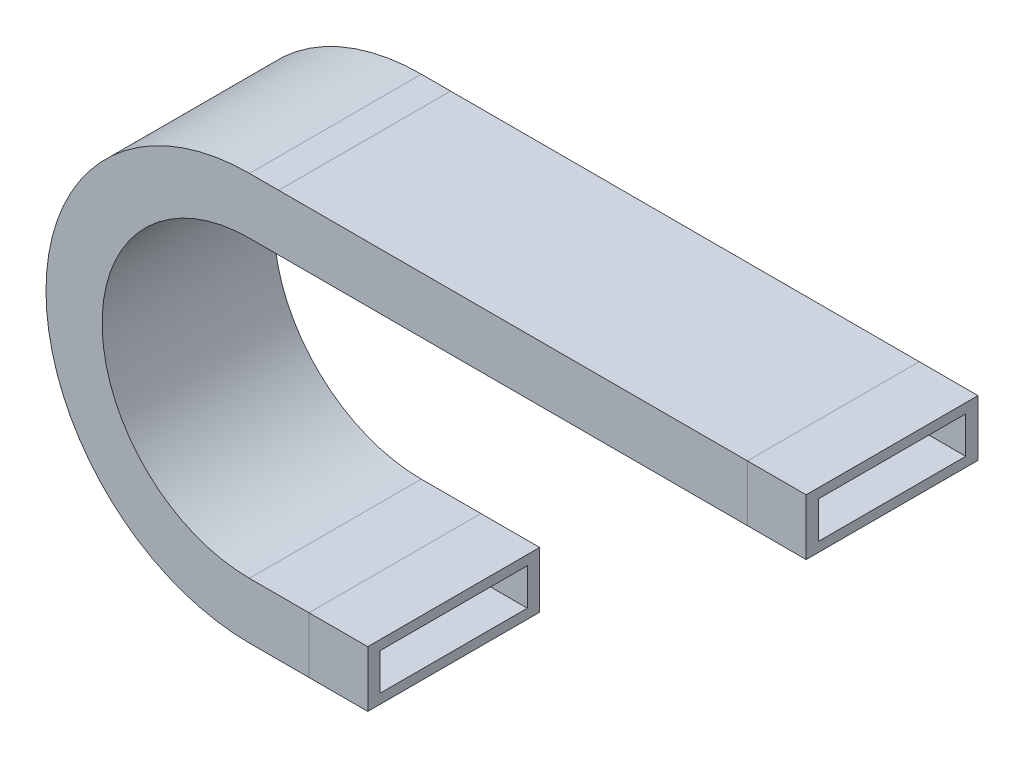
ISO-10303-21;
HEADER;
FILE_DESCRIPTION(('STEP AP214'),'2;1');
FILE_NAME('part.step','',(''),(''),'','','');
FILE_SCHEMA(('AUTOMOTIVE_DESIGN { 1 0 10303 214 1 1 1 1 }'));
ENDSEC;
DATA;
#1=APPLICATION_CONTEXT('core data for automotive mechanical design processes');
#2=APPLICATION_PROTOCOL_DEFINITION('international standard','automotive_design',2000,#1);
#3=PRODUCT_CONTEXT('',#1,'mechanical');
#4=PRODUCT('Part','Part','',(#3));
#5=PRODUCT_RELATED_PRODUCT_CATEGORY('part','',(#4));
#6=PRODUCT_DEFINITION_FORMATION('','',#4);
#7=PRODUCT_DEFINITION_CONTEXT('part definition',#1,'design');
#8=PRODUCT_DEFINITION('design','',#6,#7);
#9=PRODUCT_DEFINITION_SHAPE('','',#8);
#10=(LENGTH_UNIT() NAMED_UNIT(*) SI_UNIT(.MILLI.,.METRE.));
#11=(NAMED_UNIT(*) PLANE_ANGLE_UNIT() SI_UNIT($,.RADIAN.));
#12=(NAMED_UNIT(*) SI_UNIT($,.STERADIAN.) SOLID_ANGLE_UNIT());
#13=UNCERTAINTY_MEASURE_WITH_UNIT(LENGTH_MEASURE(1.E-05),#10,'distance_accuracy_value','');
#14=(GEOMETRIC_REPRESENTATION_CONTEXT(3) GLOBAL_UNCERTAINTY_ASSIGNED_CONTEXT((#13)) GLOBAL_UNIT_ASSIGNED_CONTEXT((#10,
#11,#12)) REPRESENTATION_CONTEXT('',''));
#15=CARTESIAN_POINT('',(0.,0.,0.));
#16=DIRECTION('',(0.,0.,1.));
#17=DIRECTION('',(1.,0.,0.));
#18=AXIS2_PLACEMENT_3D('',#15,#16,#17);
#19=CARTESIAN_POINT('',(-135.,0.,98.));
#20=DIRECTION('',(0.,1.,0.));
#21=DIRECTION('',(0.,0.,1.));
#22=AXIS2_PLACEMENT_3D('',#19,#20,#21);
#23=PLANE('',#22);
#24=DIRECTION('',(0.,0.,1.));
#25=VECTOR('',#24,1.);
#26=CARTESIAN_POINT('',(-135.,0.,98.));
#27=LINE('',#26,#25);
#28=CARTESIAN_POINT('',(-135.,0.,-98.));
#29=VERTEX_POINT('',#28);
#30=CARTESIAN_POINT('',(-135.,0.,98.));
#31=VERTEX_POINT('',#30);
#32=EDGE_CURVE('P0_E314',#29,#31,#27,.T.);
#33=ORIENTED_EDGE('',*,*,#32,.F.);
#34=DIRECTION('',(1.,0.,0.));
#35=VECTOR('',#34,1.);
#36=CARTESIAN_POINT('',(-135.,0.,-98.));
#37=LINE('',#36,#35);
#38=CARTESIAN_POINT('',(-66.9999999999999,0.,-98.));
#39=VERTEX_POINT('',#38);
#40=EDGE_CURVE('P0_E31',#29,#39,#37,.T.);
#41=ORIENTED_EDGE('',*,*,#40,.T.);
#42=DIRECTION('',(0.,0.,1.));
#43=VECTOR('',#42,1.);
#44=CARTESIAN_POINT('',(-66.9999999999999,0.,98.));
#45=LINE('',#44,#43);
#46=CARTESIAN_POINT('',(-66.9999999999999,0.,98.));
#47=VERTEX_POINT('',#46);
#48=EDGE_CURVE('P0_E38',#39,#47,#45,.T.);
#49=ORIENTED_EDGE('',*,*,#48,.T.);
#50=DIRECTION('',(1.,0.,0.));
#51=VECTOR('',#50,1.);
#52=CARTESIAN_POINT('',(-135.,0.,98.));
#53=LINE('',#52,#51);
#54=EDGE_CURVE('P0_E13',#31,#47,#53,.T.);
#55=ORIENTED_EDGE('',*,*,#54,.F.);
#56=EDGE_LOOP('',(#33,#41,#49,#55));
#57=FACE_BOUND('',#56,.T.);
#58=ADVANCED_FACE('P0_F24',(#57),#23,.F.);
#59=CARTESIAN_POINT('',(-135.,64.,98.));
#60=DIRECTION('',(0.,-1.,0.));
#61=DIRECTION('',(0.,0.,-1.));
#62=AXIS2_PLACEMENT_3D('',#59,#60,#61);
#63=PLANE('',#62);
#64=DIRECTION('',(0.,0.,-1.));
#65=VECTOR('',#64,1.);
#66=CARTESIAN_POINT('',(-135.,64.,98.));
#67=LINE('',#66,#65);
#68=CARTESIAN_POINT('',(-135.,64.,98.));
#69=VERTEX_POINT('',#68);
#70=CARTESIAN_POINT('',(-135.,64.,-98.));
#71=VERTEX_POINT('',#70);
#72=EDGE_CURVE('P0_E311',#69,#71,#67,.T.);
#73=ORIENTED_EDGE('',*,*,#72,.F.);
#74=DIRECTION('',(1.,0.,0.));
#75=VECTOR('',#74,1.);
#76=CARTESIAN_POINT('',(-135.,64.,98.));
#77=LINE('',#76,#75);
#78=CARTESIAN_POINT('',(-66.9999999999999,64.,98.));
#79=VERTEX_POINT('',#78);
#80=EDGE_CURVE('P0_E337',#69,#79,#77,.T.);
#81=ORIENTED_EDGE('',*,*,#80,.T.);
#82=DIRECTION('',(0.,0.,-1.));
#83=VECTOR('',#82,1.);
#84=CARTESIAN_POINT('',(-66.9999999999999,64.,98.));
#85=LINE('',#84,#83);
#86=CARTESIAN_POINT('',(-66.9999999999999,64.,-98.));
#87=VERTEX_POINT('',#86);
#88=EDGE_CURVE('P0_E332',#79,#87,#85,.T.);
#89=ORIENTED_EDGE('',*,*,#88,.T.);
#90=DIRECTION('',(1.,0.,0.));
#91=VECTOR('',#90,1.);
#92=CARTESIAN_POINT('',(-135.,64.,-98.));
#93=LINE('',#92,#91);
#94=EDGE_CURVE('P0_E350',#71,#87,#93,.T.);
#95=ORIENTED_EDGE('',*,*,#94,.F.);
#96=EDGE_LOOP('',(#73,#81,#89,#95));
#97=FACE_BOUND('',#96,.T.);
#98=ADVANCED_FACE('P0_F429',(#97),#63,.F.);
#99=CARTESIAN_POINT('',(-135.,53.,84.));
#100=DIRECTION('',(0.,-1.,0.));
#101=DIRECTION('',(0.,0.,-1.));
#102=AXIS2_PLACEMENT_3D('',#99,#100,#101);
#103=PLANE('',#102);
#104=DIRECTION('',(0.,0.,-1.));
#105=VECTOR('',#104,1.);
#106=CARTESIAN_POINT('',(-135.,53.,84.));
#107=LINE('',#106,#105);
#108=CARTESIAN_POINT('',(-135.,53.,84.));
#109=VERTEX_POINT('',#108);
#110=CARTESIAN_POINT('',(-135.,53.,-84.));
#111=VERTEX_POINT('',#110);
#112=EDGE_CURVE('P0_E308',#109,#111,#107,.T.);
#113=ORIENTED_EDGE('',*,*,#112,.T.);
#114=DIRECTION('',(1.,0.,0.));
#115=VECTOR('',#114,1.);
#116=CARTESIAN_POINT('',(-135.,53.,-84.));
#117=LINE('',#116,#115);
#118=CARTESIAN_POINT('',(-66.9999999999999,53.,-84.));
#119=VERTEX_POINT('',#118);
#120=EDGE_CURVE('P0_E343',#111,#119,#117,.T.);
#121=ORIENTED_EDGE('',*,*,#120,.T.);
#122=DIRECTION('',(0.,0.,-1.));
#123=VECTOR('',#122,1.);
#124=CARTESIAN_POINT('',(-66.9999999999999,53.,84.));
#125=LINE('',#124,#123);
#126=CARTESIAN_POINT('',(-66.9999999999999,53.,84.));
#127=VERTEX_POINT('',#126);
#128=EDGE_CURVE('P0_E326',#127,#119,#125,.T.);
#129=ORIENTED_EDGE('',*,*,#128,.F.);
#130=DIRECTION('',(1.,0.,0.));
#131=VECTOR('',#130,1.);
#132=CARTESIAN_POINT('',(-135.,53.,84.));
#133=LINE('',#132,#131);
#134=EDGE_CURVE('P0_E333',#109,#127,#133,.T.);
#135=ORIENTED_EDGE('',*,*,#134,.F.);
#136=EDGE_LOOP('',(#113,#121,#129,#135));
#137=FACE_BOUND('',#136,.T.);
#138=ADVANCED_FACE('P0_F447',(#137),#103,.T.);
#139=CARTESIAN_POINT('',(-135.,11.,84.));
#140=DIRECTION('',(0.,1.,0.));
#141=DIRECTION('',(0.,0.,1.));
#142=AXIS2_PLACEMENT_3D('',#139,#140,#141);
#143=PLANE('',#142);
#144=DIRECTION('',(0.,0.,1.));
#145=VECTOR('',#144,1.);
#146=CARTESIAN_POINT('',(-135.,11.,84.));
#147=LINE('',#146,#145);
#148=CARTESIAN_POINT('',(-135.,11.,-84.));
#149=VERTEX_POINT('',#148);
#150=CARTESIAN_POINT('',(-135.,11.,84.));
#151=VERTEX_POINT('',#150);
#152=EDGE_CURVE('P0_E305',#149,#151,#147,.T.);
#153=ORIENTED_EDGE('',*,*,#152,.T.);
#154=DIRECTION('',(1.,0.,0.));
#155=VECTOR('',#154,1.);
#156=CARTESIAN_POINT('',(-135.,11.,84.));
#157=LINE('',#156,#155);
#158=CARTESIAN_POINT('',(-66.9999999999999,11.,84.));
#159=VERTEX_POINT('',#158);
#160=EDGE_CURVE('P0_E329',#151,#159,#157,.T.);
#161=ORIENTED_EDGE('',*,*,#160,.T.);
#162=DIRECTION('',(0.,0.,1.));
#163=VECTOR('',#162,1.);
#164=CARTESIAN_POINT('',(-66.9999999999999,11.,84.));
#165=LINE('',#164,#163);
#166=CARTESIAN_POINT('',(-66.9999999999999,11.,-84.));
#167=VERTEX_POINT('',#166);
#168=EDGE_CURVE('P0_E320',#167,#159,#165,.T.);
#169=ORIENTED_EDGE('',*,*,#168,.F.);
#170=DIRECTION('',(1.,0.,0.));
#171=VECTOR('',#170,1.);
#172=CARTESIAN_POINT('',(-135.,11.,-84.));
#173=LINE('',#172,#171);
#174=EDGE_CURVE('P0_E340',#149,#167,#173,.T.);
#175=ORIENTED_EDGE('',*,*,#174,.F.);
#176=EDGE_LOOP('',(#153,#161,#169,#175));
#177=FACE_BOUND('',#176,.T.);
#178=ADVANCED_FACE('P0_F451',(#177),#143,.T.);
#179=CARTESIAN_POINT('',(-135.,232.01,0.));
#180=DIRECTION('',(0.,0.,1.));
#181=DIRECTION('',(1.,0.,0.));
#182=AXIS2_PLACEMENT_3D('',#179,#180,#181);
#183=CYLINDRICAL_SURFACE('',#182,232.01);
#184=DIRECTION('',(0.,0.,1.));
#185=VECTOR('',#184,1.);
#186=CARTESIAN_POINT('',(-134.86094750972,464.019958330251,98.));
#187=LINE('',#186,#185);
#188=CARTESIAN_POINT('',(-134.86094750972,464.019958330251,-98.));
#189=VERTEX_POINT('',#188);
#190=CARTESIAN_POINT('',(-134.86094750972,464.019958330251,98.));
#191=VERTEX_POINT('',#190);
#192=EDGE_CURVE('P0_E264',#189,#191,#187,.T.);
#193=ORIENTED_EDGE('',*,*,#192,.F.);
#194=CARTESIAN_POINT('',(-135.,232.01,-98.));
#195=DIRECTION('',(0.,0.,1.));
#196=DIRECTION('',(1.,0.,0.));
#197=AXIS2_PLACEMENT_3D('',#194,#195,#196);
#198=CIRCLE('',#197,232.01);
#199=EDGE_CURVE('P0_E301',#189,#29,#198,.T.);
#200=ORIENTED_EDGE('',*,*,#199,.T.);
#201=ORIENTED_EDGE('',*,*,#32,.T.);
#202=CARTESIAN_POINT('',(-135.,232.01,98.));
#203=DIRECTION('',(0.,0.,1.));
#204=DIRECTION('',(1.,0.,0.));
#205=AXIS2_PLACEMENT_3D('',#202,#203,#204);
#206=CIRCLE('',#205,232.01);
#207=EDGE_CURVE('P0_E303',#191,#31,#206,.T.);
#208=ORIENTED_EDGE('',*,*,#207,.F.);
#209=EDGE_LOOP('',(#193,#200,#201,#208));
#210=FACE_BOUND('',#209,.T.);
#211=ADVANCED_FACE('P0_F357',(#210),#183,.T.);
#212=CARTESIAN_POINT('',(-135.,232.01,0.));
#213=DIRECTION('',(0.,0.,1.));
#214=DIRECTION('',(1.,0.,0.));
#215=AXIS2_PLACEMENT_3D('',#212,#213,#214);
#216=CYLINDRICAL_SURFACE('',#215,168.01);
#217=DIRECTION('',(0.,0.,-1.));
#218=VECTOR('',#217,1.);
#219=CARTESIAN_POINT('',(-134.899305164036,400.019969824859,98.));
#220=LINE('',#219,#218);
#221=CARTESIAN_POINT('',(-134.899305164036,400.019969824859,98.));
#222=VERTEX_POINT('',#221);
#223=CARTESIAN_POINT('',(-134.899305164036,400.019969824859,-98.));
#224=VERTEX_POINT('',#223);
#225=EDGE_CURVE('P0_E261',#222,#224,#220,.T.);
#226=ORIENTED_EDGE('',*,*,#225,.F.);
#227=CARTESIAN_POINT('',(-135.,232.01,98.));
#228=DIRECTION('',(0.,0.,1.));
#229=DIRECTION('',(1.,0.,0.));
#230=AXIS2_PLACEMENT_3D('',#227,#228,#229);
#231=CIRCLE('',#230,168.01);
#232=EDGE_CURVE('P0_E297',#222,#69,#231,.T.);
#233=ORIENTED_EDGE('',*,*,#232,.T.);
#234=ORIENTED_EDGE('',*,*,#72,.T.);
#235=CARTESIAN_POINT('',(-135.,232.01,-98.));
#236=DIRECTION('',(0.,0.,1.));
#237=DIRECTION('',(1.,0.,0.));
#238=AXIS2_PLACEMENT_3D('',#235,#236,#237);
#239=CIRCLE('',#238,168.01);
#240=EDGE_CURVE('P0_E299',#224,#71,#239,.T.);
#241=ORIENTED_EDGE('',*,*,#240,.F.);
#242=EDGE_LOOP('',(#226,#233,#234,#241));
#243=FACE_BOUND('',#242,.T.);
#244=ADVANCED_FACE('P0_F424',(#243),#216,.F.);
#245=CARTESIAN_POINT('',(-135.,232.01,0.));
#246=DIRECTION('',(0.,0.,1.));
#247=DIRECTION('',(1.,0.,0.));
#248=AXIS2_PLACEMENT_3D('',#245,#246,#247);
#249=CYLINDRICAL_SURFACE('',#248,179.01);
#250=DIRECTION('',(0.,0.,-1.));
#251=VECTOR('',#250,1.);
#252=CARTESIAN_POINT('',(-134.892712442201,411.019967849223,84.));
#253=LINE('',#252,#251);
#254=CARTESIAN_POINT('',(-134.892712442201,411.019967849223,84.));
#255=VERTEX_POINT('',#254);
#256=CARTESIAN_POINT('',(-134.892712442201,411.019967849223,-84.));
#257=VERTEX_POINT('',#256);
#258=EDGE_CURVE('P0_E258',#255,#257,#253,.T.);
#259=ORIENTED_EDGE('',*,*,#258,.T.);
#260=CARTESIAN_POINT('',(-135.,232.01,-84.));
#261=DIRECTION('',(0.,0.,1.));
#262=DIRECTION('',(1.,0.,0.));
#263=AXIS2_PLACEMENT_3D('',#260,#261,#262);
#264=CIRCLE('',#263,179.01);
#265=EDGE_CURVE('P0_E293',#257,#111,#264,.T.);
#266=ORIENTED_EDGE('',*,*,#265,.T.);
#267=ORIENTED_EDGE('',*,*,#112,.F.);
#268=CARTESIAN_POINT('',(-135.,232.01,84.));
#269=DIRECTION('',(0.,0.,1.));
#270=DIRECTION('',(1.,0.,0.));
#271=AXIS2_PLACEMENT_3D('',#268,#269,#270);
#272=CIRCLE('',#271,179.01);
#273=EDGE_CURVE('P0_E295',#255,#109,#272,.T.);
#274=ORIENTED_EDGE('',*,*,#273,.F.);
#275=EDGE_LOOP('',(#259,#266,#267,#274));
#276=FACE_BOUND('',#275,.T.);
#277=ADVANCED_FACE('P0_F462',(#276),#249,.T.);
#278=CARTESIAN_POINT('',(-135.,232.01,0.));
#279=DIRECTION('',(0.,0.,1.));
#280=DIRECTION('',(1.,0.,0.));
#281=AXIS2_PLACEMENT_3D('',#278,#279,#280);
#282=CYLINDRICAL_SURFACE('',#281,221.01);
#283=DIRECTION('',(0.,0.,1.));
#284=VECTOR('',#283,1.);
#285=CARTESIAN_POINT('',(-134.867540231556,453.019960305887,84.));
#286=LINE('',#285,#284);
#287=CARTESIAN_POINT('',(-134.867540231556,453.019960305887,-84.));
#288=VERTEX_POINT('',#287);
#289=CARTESIAN_POINT('',(-134.867540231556,453.019960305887,84.));
#290=VERTEX_POINT('',#289);
#291=EDGE_CURVE('P0_E255',#288,#290,#286,.T.);
#292=ORIENTED_EDGE('',*,*,#291,.T.);
#293=CARTESIAN_POINT('',(-135.,232.01,84.));
#294=DIRECTION('',(0.,0.,1.));
#295=DIRECTION('',(1.,0.,0.));
#296=AXIS2_PLACEMENT_3D('',#293,#294,#295);
#297=CIRCLE('',#296,221.01);
#298=EDGE_CURVE('P0_E289',#290,#151,#297,.T.);
#299=ORIENTED_EDGE('',*,*,#298,.T.);
#300=ORIENTED_EDGE('',*,*,#152,.F.);
#301=CARTESIAN_POINT('',(-135.,232.01,-84.));
#302=DIRECTION('',(0.,0.,1.));
#303=DIRECTION('',(1.,0.,0.));
#304=AXIS2_PLACEMENT_3D('',#301,#302,#303);
#305=CIRCLE('',#304,221.01);
#306=EDGE_CURVE('P0_E291',#288,#149,#305,.T.);
#307=ORIENTED_EDGE('',*,*,#306,.F.);
#308=EDGE_LOOP('',(#292,#299,#300,#307));
#309=FACE_BOUND('',#308,.T.);
#310=ADVANCED_FACE('P0_F465',(#309),#282,.F.);
#311=CARTESIAN_POINT('',(-101.610694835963,464.000030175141,98.));
#312=DIRECTION('',(-0.000599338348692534,-0.999999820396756,0.));
#313=DIRECTION('',(0.999999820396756,-0.000599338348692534,0.));
#314=AXIS2_PLACEMENT_3D('',#311,#312,#313);
#315=PLANE('',#314);
#316=DIRECTION('',(0.,0.,1.));
#317=VECTOR('',#316,1.);
#318=CARTESIAN_POINT('',(-101.610694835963,464.000030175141,98.));
#319=LINE('',#318,#317);
#320=CARTESIAN_POINT('',(-101.610694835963,464.000030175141,-98.));
#321=VERTEX_POINT('',#320);
#322=CARTESIAN_POINT('',(-101.610694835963,464.000030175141,98.));
#323=VERTEX_POINT('',#322);
#324=EDGE_CURVE('P0_E233',#321,#323,#319,.T.);
#325=ORIENTED_EDGE('',*,*,#324,.F.);
#326=DIRECTION('',(-0.999999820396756,0.000599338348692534,0.));
#327=VECTOR('',#326,1.);
#328=CARTESIAN_POINT('',(-101.610694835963,464.000030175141,-98.));
#329=LINE('',#328,#327);
#330=EDGE_CURVE('P0_E283',#321,#189,#329,.T.);
#331=ORIENTED_EDGE('',*,*,#330,.T.);
#332=ORIENTED_EDGE('',*,*,#192,.T.);
#333=DIRECTION('',(-0.999999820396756,0.000599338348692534,0.));
#334=VECTOR('',#333,1.);
#335=CARTESIAN_POINT('',(-101.610694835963,464.000030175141,98.));
#336=LINE('',#335,#334);
#337=EDGE_CURVE('P0_E286',#323,#191,#336,.T.);
#338=ORIENTED_EDGE('',*,*,#337,.F.);
#339=EDGE_LOOP('',(#325,#331,#332,#338));
#340=FACE_BOUND('',#339,.T.);
#341=ADVANCED_FACE('P0_F359',(#340),#315,.F.);
#342=CARTESIAN_POINT('',(-101.649052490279,400.000041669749,98.));
#343=DIRECTION('',(0.000599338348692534,0.999999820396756,0.));
#344=DIRECTION('',(-0.999999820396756,0.000599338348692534,0.));
#345=AXIS2_PLACEMENT_3D('',#342,#343,#344);
#346=PLANE('',#345);
#347=DIRECTION('',(0.,0.,-1.));
#348=VECTOR('',#347,1.);
#349=CARTESIAN_POINT('',(-101.649052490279,400.000041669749,98.));
#350=LINE('',#349,#348);
#351=CARTESIAN_POINT('',(-101.649052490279,400.000041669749,98.));
#352=VERTEX_POINT('',#351);
#353=CARTESIAN_POINT('',(-101.649052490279,400.000041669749,-98.));
#354=VERTEX_POINT('',#353);
#355=EDGE_CURVE('P0_E230',#352,#354,#350,.T.);
#356=ORIENTED_EDGE('',*,*,#355,.F.);
#357=DIRECTION('',(-0.999999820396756,0.000599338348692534,0.));
#358=VECTOR('',#357,1.);
#359=CARTESIAN_POINT('',(-101.649052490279,400.000041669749,98.));
#360=LINE('',#359,#358);
#361=EDGE_CURVE('P0_E268',#352,#222,#360,.T.);
#362=ORIENTED_EDGE('',*,*,#361,.T.);
#363=ORIENTED_EDGE('',*,*,#225,.T.);
#364=DIRECTION('',(-0.999999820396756,0.000599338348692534,0.));
#365=VECTOR('',#364,1.);
#366=CARTESIAN_POINT('',(-101.649052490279,400.000041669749,-98.));
#367=LINE('',#366,#365);
#368=EDGE_CURVE('P0_E280',#354,#224,#367,.T.);
#369=ORIENTED_EDGE('',*,*,#368,.F.);
#370=EDGE_LOOP('',(#356,#362,#363,#369));
#371=FACE_BOUND('',#370,.T.);
#372=ADVANCED_FACE('P0_F421',(#371),#346,.F.);
#373=CARTESIAN_POINT('',(-101.642459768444,411.000039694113,84.));
#374=DIRECTION('',(0.000599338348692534,0.999999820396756,0.));
#375=DIRECTION('',(-0.999999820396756,0.000599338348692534,0.));
#376=AXIS2_PLACEMENT_3D('',#373,#374,#375);
#377=PLANE('',#376);
#378=DIRECTION('',(0.,0.,-1.));
#379=VECTOR('',#378,1.);
#380=CARTESIAN_POINT('',(-101.642459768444,411.000039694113,84.));
#381=LINE('',#380,#379);
#382=CARTESIAN_POINT('',(-101.642459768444,411.000039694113,84.));
#383=VERTEX_POINT('',#382);
#384=CARTESIAN_POINT('',(-101.642459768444,411.000039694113,-84.));
#385=VERTEX_POINT('',#384);
#386=EDGE_CURVE('P0_E200',#383,#385,#381,.T.);
#387=ORIENTED_EDGE('',*,*,#386,.T.);
#388=DIRECTION('',(-0.999999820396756,0.000599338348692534,0.));
#389=VECTOR('',#388,1.);
#390=CARTESIAN_POINT('',(-101.642459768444,411.000039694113,-84.));
#391=LINE('',#390,#389);
#392=EDGE_CURVE('P0_E273',#385,#257,#391,.T.);
#393=ORIENTED_EDGE('',*,*,#392,.T.);
#394=ORIENTED_EDGE('',*,*,#258,.F.);
#395=DIRECTION('',(-0.999999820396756,0.000599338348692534,0.));
#396=VECTOR('',#395,1.);
#397=CARTESIAN_POINT('',(-101.642459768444,411.000039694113,84.));
#398=LINE('',#397,#396);
#399=EDGE_CURVE('P0_E265',#383,#255,#398,.T.);
#400=ORIENTED_EDGE('',*,*,#399,.F.);
#401=EDGE_LOOP('',(#387,#393,#394,#400));
#402=FACE_BOUND('',#401,.T.);
#403=ADVANCED_FACE('P0_F474',(#402),#377,.T.);
#404=CARTESIAN_POINT('',(-101.617287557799,453.000032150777,84.));
#405=DIRECTION('',(-0.000599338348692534,-0.999999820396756,0.));
#406=DIRECTION('',(0.999999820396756,-0.000599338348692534,0.));
#407=AXIS2_PLACEMENT_3D('',#404,#405,#406);
#408=PLANE('',#407);
#409=DIRECTION('',(0.,0.,1.));
#410=VECTOR('',#409,1.);
#411=CARTESIAN_POINT('',(-101.617287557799,453.000032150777,84.));
#412=LINE('',#411,#410);
#413=CARTESIAN_POINT('',(-101.617287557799,453.000032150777,-84.));
#414=VERTEX_POINT('',#413);
#415=CARTESIAN_POINT('',(-101.617287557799,453.000032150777,84.));
#416=VERTEX_POINT('',#415);
#417=EDGE_CURVE('P0_E225',#414,#416,#412,.T.);
#418=ORIENTED_EDGE('',*,*,#417,.T.);
#419=DIRECTION('',(-0.999999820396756,0.000599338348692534,0.));
#420=VECTOR('',#419,1.);
#421=CARTESIAN_POINT('',(-101.617287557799,453.000032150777,84.));
#422=LINE('',#421,#420);
#423=EDGE_CURVE('P0_E195',#416,#290,#422,.T.);
#424=ORIENTED_EDGE('',*,*,#423,.T.);
#425=ORIENTED_EDGE('',*,*,#291,.F.);
#426=DIRECTION('',(-0.999999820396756,0.000599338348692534,0.));
#427=VECTOR('',#426,1.);
#428=CARTESIAN_POINT('',(-101.617287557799,453.000032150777,-84.));
#429=LINE('',#428,#427);
#430=EDGE_CURVE('P0_E270',#414,#288,#429,.T.);
#431=ORIENTED_EDGE('',*,*,#430,.F.);
#432=EDGE_LOOP('',(#418,#424,#425,#431));
#433=FACE_BOUND('',#432,.T.);
#434=ADVANCED_FACE('P0_F477',(#433),#408,.T.);
#435=CARTESIAN_POINT('',(-101.51,632.01,0.));
#436=DIRECTION('',(0.,0.,-1.));
#437=DIRECTION('',(-1.,0.,0.));
#438=AXIS2_PLACEMENT_3D('',#435,#436,#437);
#439=CYLINDRICAL_SURFACE('',#438,168.01);
#440=DIRECTION('',(0.,0.,1.));
#441=VECTOR('',#440,1.);
#442=CARTESIAN_POINT('',(-101.51,464.,98.));
#443=LINE('',#442,#441);
#444=CARTESIAN_POINT('',(-101.51,464.,-98.));
#445=VERTEX_POINT('',#444);
#446=CARTESIAN_POINT('',(-101.51,464.,98.));
#447=VERTEX_POINT('',#446);
#448=EDGE_CURVE('P0_E216',#445,#447,#443,.T.);
#449=ORIENTED_EDGE('',*,*,#448,.F.);
#450=CARTESIAN_POINT('',(-101.51,632.01,-98.));
#451=DIRECTION('',(0.,0.,-1.));
#452=DIRECTION('',(-1.,0.,0.));
#453=AXIS2_PLACEMENT_3D('',#450,#451,#452);
#454=CIRCLE('',#453,168.01);
#455=EDGE_CURVE('P0_E249',#445,#321,#454,.T.);
#456=ORIENTED_EDGE('',*,*,#455,.T.);
#457=ORIENTED_EDGE('',*,*,#324,.T.);
#458=CARTESIAN_POINT('',(-101.51,632.01,98.));
#459=DIRECTION('',(0.,0.,-1.));
#460=DIRECTION('',(-1.,0.,0.));
#461=AXIS2_PLACEMENT_3D('',#458,#459,#460);
#462=CIRCLE('',#461,168.01);
#463=EDGE_CURVE('P0_E252',#447,#323,#462,.T.);
#464=ORIENTED_EDGE('',*,*,#463,.F.);
#465=EDGE_LOOP('',(#449,#456,#457,#464));
#466=FACE_BOUND('',#465,.T.);
#467=ADVANCED_FACE('P0_F362',(#466),#439,.F.);
#468=CARTESIAN_POINT('',(-101.51,632.01,0.));
#469=DIRECTION('',(0.,0.,-1.));
#470=DIRECTION('',(-1.,0.,0.));
#471=AXIS2_PLACEMENT_3D('',#468,#469,#470);
#472=CYLINDRICAL_SURFACE('',#471,232.01);
#473=DIRECTION('',(0.,0.,-1.));
#474=VECTOR('',#473,1.);
#475=CARTESIAN_POINT('',(-101.51,400.,98.));
#476=LINE('',#475,#474);
#477=CARTESIAN_POINT('',(-101.51,400.,98.));
#478=VERTEX_POINT('',#477);
#479=CARTESIAN_POINT('',(-101.51,400.,-98.));
#480=VERTEX_POINT('',#479);
#481=EDGE_CURVE('P0_E221',#478,#480,#476,.T.);
#482=ORIENTED_EDGE('',*,*,#481,.F.);
#483=CARTESIAN_POINT('',(-101.51,632.01,98.));
#484=DIRECTION('',(0.,0.,-1.));
#485=DIRECTION('',(-1.,0.,0.));
#486=AXIS2_PLACEMENT_3D('',#483,#484,#485);
#487=CIRCLE('',#486,232.01);
#488=EDGE_CURVE('P0_E236',#478,#352,#487,.T.);
#489=ORIENTED_EDGE('',*,*,#488,.T.);
#490=ORIENTED_EDGE('',*,*,#355,.T.);
#491=CARTESIAN_POINT('',(-101.51,632.01,-98.));
#492=DIRECTION('',(0.,0.,-1.));
#493=DIRECTION('',(-1.,0.,0.));
#494=AXIS2_PLACEMENT_3D('',#491,#492,#493);
#495=CIRCLE('',#494,232.01);
#496=EDGE_CURVE('P0_E246',#480,#354,#495,.T.);
#497=ORIENTED_EDGE('',*,*,#496,.F.);
#498=EDGE_LOOP('',(#482,#489,#490,#497));
#499=FACE_BOUND('',#498,.T.);
#500=ADVANCED_FACE('P0_F418',(#499),#472,.T.);
#501=CARTESIAN_POINT('',(-101.51,632.01,0.));
#502=DIRECTION('',(0.,0.,-1.));
#503=DIRECTION('',(-1.,0.,0.));
#504=AXIS2_PLACEMENT_3D('',#501,#502,#503);
#505=CYLINDRICAL_SURFACE('',#504,221.01);
#506=DIRECTION('',(0.,0.,-1.));
#507=VECTOR('',#506,1.);
#508=CARTESIAN_POINT('',(-101.51,411.,84.));
#509=LINE('',#508,#507);
#510=CARTESIAN_POINT('',(-101.51,411.,84.));
#511=VERTEX_POINT('',#510);
#512=CARTESIAN_POINT('',(-101.51,411.,-84.));
#513=VERTEX_POINT('',#512);
#514=EDGE_CURVE('P0_E209',#511,#513,#509,.T.);
#515=ORIENTED_EDGE('',*,*,#514,.T.);
#516=CARTESIAN_POINT('',(-101.51,632.01,-84.));
#517=DIRECTION('',(0.,0.,-1.));
#518=DIRECTION('',(-1.,0.,0.));
#519=AXIS2_PLACEMENT_3D('',#516,#517,#518);
#520=CIRCLE('',#519,221.01);
#521=EDGE_CURVE('P0_E239',#513,#385,#520,.T.);
#522=ORIENTED_EDGE('',*,*,#521,.T.);
#523=ORIENTED_EDGE('',*,*,#386,.F.);
#524=CARTESIAN_POINT('',(-101.51,632.01,84.));
#525=DIRECTION('',(0.,0.,-1.));
#526=DIRECTION('',(-1.,0.,0.));
#527=AXIS2_PLACEMENT_3D('',#524,#525,#526);
#528=CIRCLE('',#527,221.01);
#529=EDGE_CURVE('P0_E234',#511,#383,#528,.T.);
#530=ORIENTED_EDGE('',*,*,#529,.F.);
#531=EDGE_LOOP('',(#515,#522,#523,#530));
#532=FACE_BOUND('',#531,.T.);
#533=ADVANCED_FACE('P0_F486',(#532),#505,.F.);
#534=CARTESIAN_POINT('',(-101.51,632.01,0.));
#535=DIRECTION('',(0.,0.,-1.));
#536=DIRECTION('',(-1.,0.,0.));
#537=AXIS2_PLACEMENT_3D('',#534,#535,#536);
#538=CYLINDRICAL_SURFACE('',#537,179.01);
#539=DIRECTION('',(0.,0.,1.));
#540=VECTOR('',#539,1.);
#541=CARTESIAN_POINT('',(-101.51,453.,84.));
#542=LINE('',#541,#540);
#543=CARTESIAN_POINT('',(-101.51,453.,-84.));
#544=VERTEX_POINT('',#543);
#545=CARTESIAN_POINT('',(-101.51,453.,84.));
#546=VERTEX_POINT('',#545);
#547=EDGE_CURVE('P0_E203',#544,#546,#542,.T.);
#548=ORIENTED_EDGE('',*,*,#547,.T.);
#549=CARTESIAN_POINT('',(-101.51,632.01,84.));
#550=DIRECTION('',(0.,0.,-1.));
#551=DIRECTION('',(-1.,0.,0.));
#552=AXIS2_PLACEMENT_3D('',#549,#550,#551);
#553=CIRCLE('',#552,179.01);
#554=EDGE_CURVE('P0_E187',#546,#416,#553,.T.);
#555=ORIENTED_EDGE('',*,*,#554,.T.);
#556=ORIENTED_EDGE('',*,*,#417,.F.);
#557=CARTESIAN_POINT('',(-101.51,632.01,-84.));
#558=DIRECTION('',(0.,0.,-1.));
#559=DIRECTION('',(-1.,0.,0.));
#560=AXIS2_PLACEMENT_3D('',#557,#558,#559);
#561=CIRCLE('',#560,179.01);
#562=EDGE_CURVE('P0_E199',#544,#414,#561,.T.);
#563=ORIENTED_EDGE('',*,*,#562,.F.);
#564=EDGE_LOOP('',(#548,#555,#556,#563));
#565=FACE_BOUND('',#564,.T.);
#566=ADVANCED_FACE('P0_F204',(#565),#538,.T.);
#567=CARTESIAN_POINT('',(-101.51,464.,98.));
#568=DIRECTION('',(0.,0.,1.));
#569=DIRECTION('',(1.,0.,0.));
#570=AXIS2_PLACEMENT_3D('',#567,#568,#569);
#571=PLANE('',#570);
#572=DIRECTION('',(0.,-1.,0.));
#573=VECTOR('',#572,1.);
#574=CARTESIAN_POINT('',(433.,464.,98.));
#575=LINE('',#574,#573);
#576=CARTESIAN_POINT('',(433.,464.,98.));
#577=VERTEX_POINT('',#576);
#578=CARTESIAN_POINT('',(433.,400.,98.));
#579=VERTEX_POINT('',#578);
#580=EDGE_CURVE('P0_E404',#577,#579,#575,.T.);
#581=ORIENTED_EDGE('',*,*,#580,.F.);
#582=DIRECTION('',(1.,0.,0.));
#583=VECTOR('',#582,1.);
#584=CARTESIAN_POINT('',(-101.51,464.,98.));
#585=LINE('',#584,#583);
#586=EDGE_CURVE('P0_E227',#447,#577,#585,.T.);
#587=ORIENTED_EDGE('',*,*,#586,.F.);
#588=ORIENTED_EDGE('',*,*,#463,.T.);
#589=ORIENTED_EDGE('',*,*,#337,.T.);
#590=ORIENTED_EDGE('',*,*,#207,.T.);
#591=ORIENTED_EDGE('',*,*,#54,.T.);
#592=DIRECTION('',(0.,1.,0.));
#593=VECTOR('',#592,1.);
#594=CARTESIAN_POINT('',(-66.9999999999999,0.,98.));
#595=LINE('',#594,#593);
#596=EDGE_CURVE('P0_E330',#47,#79,#595,.T.);
#597=ORIENTED_EDGE('',*,*,#596,.T.);
#598=ORIENTED_EDGE('',*,*,#80,.F.);
#599=ORIENTED_EDGE('',*,*,#232,.F.);
#600=ORIENTED_EDGE('',*,*,#361,.F.);
#601=ORIENTED_EDGE('',*,*,#488,.F.);
#602=DIRECTION('',(1.,0.,0.));
#603=VECTOR('',#602,1.);
#604=CARTESIAN_POINT('',(-101.51,400.,98.));
#605=LINE('',#604,#603);
#606=EDGE_CURVE('P0_E388',#478,#579,#605,.T.);
#607=ORIENTED_EDGE('',*,*,#606,.T.);
#608=EDGE_LOOP('',(#581,#587,#588,#589,#590,#591,#597,#598,#599,#600,#601,#607));
#609=FACE_BOUND('',#608,.T.);
#610=ADVANCED_FACE('P0_F411',(#609),#571,.T.);
#611=CARTESIAN_POINT('',(-101.51,464.,98.));
#612=DIRECTION('',(0.,1.,0.));
#613=DIRECTION('',(-1.,0.,0.));
#614=AXIS2_PLACEMENT_3D('',#611,#612,#613);
#615=PLANE('',#614);
#616=DIRECTION('',(0.,0.,1.));
#617=VECTOR('',#616,1.);
#618=CARTESIAN_POINT('',(433.,464.,98.));
#619=LINE('',#618,#617);
#620=CARTESIAN_POINT('',(433.,464.,-98.));
#621=VERTEX_POINT('',#620);
#622=EDGE_CURVE('P0_E210',#621,#577,#619,.T.);
#623=ORIENTED_EDGE('',*,*,#622,.F.);
#624=DIRECTION('',(1.,0.,0.));
#625=VECTOR('',#624,1.);
#626=CARTESIAN_POINT('',(-101.51,464.,-98.));
#627=LINE('',#626,#625);
#628=EDGE_CURVE('P0_E364',#445,#621,#627,.T.);
#629=ORIENTED_EDGE('',*,*,#628,.F.);
#630=ORIENTED_EDGE('',*,*,#448,.T.);
#631=ORIENTED_EDGE('',*,*,#586,.T.);
#632=EDGE_LOOP('',(#623,#629,#630,#631));
#633=FACE_BOUND('',#632,.T.);
#634=ADVANCED_FACE('P0_F380',(#633),#615,.T.);
#635=CARTESIAN_POINT('',(-101.51,464.,-98.));
#636=DIRECTION('',(0.,0.,-1.));
#637=DIRECTION('',(-1.,0.,0.));
#638=AXIS2_PLACEMENT_3D('',#635,#636,#637);
#639=PLANE('',#638);
#640=DIRECTION('',(0.,1.,0.));
#641=VECTOR('',#640,1.);
#642=CARTESIAN_POINT('',(433.,464.,-98.));
#643=LINE('',#642,#641);
#644=CARTESIAN_POINT('',(433.,400.,-98.));
#645=VERTEX_POINT('',#644);
#646=EDGE_CURVE('P0_E367',#645,#621,#643,.T.);
#647=ORIENTED_EDGE('',*,*,#646,.F.);
#648=DIRECTION('',(1.,0.,0.));
#649=VECTOR('',#648,1.);
#650=CARTESIAN_POINT('',(-101.51,400.,-98.));
#651=LINE('',#650,#649);
#652=EDGE_CURVE('P0_E371',#480,#645,#651,.T.);
#653=ORIENTED_EDGE('',*,*,#652,.F.);
#654=ORIENTED_EDGE('',*,*,#496,.T.);
#655=ORIENTED_EDGE('',*,*,#368,.T.);
#656=ORIENTED_EDGE('',*,*,#240,.T.);
#657=ORIENTED_EDGE('',*,*,#94,.T.);
#658=DIRECTION('',(0.,-1.,0.));
#659=VECTOR('',#658,1.);
#660=CARTESIAN_POINT('',(-66.9999999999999,0.,-98.));
#661=LINE('',#660,#659);
#662=EDGE_CURVE('P0_E46',#87,#39,#661,.T.);
#663=ORIENTED_EDGE('',*,*,#662,.T.);
#664=ORIENTED_EDGE('',*,*,#40,.F.);
#665=ORIENTED_EDGE('',*,*,#199,.F.);
#666=ORIENTED_EDGE('',*,*,#330,.F.);
#667=ORIENTED_EDGE('',*,*,#455,.F.);
#668=ORIENTED_EDGE('',*,*,#628,.T.);
#669=EDGE_LOOP('',(#647,#653,#654,#655,#656,#657,#663,#664,#665,#666,#667,#668));
#670=FACE_BOUND('',#669,.T.);
#671=ADVANCED_FACE('P0_F353',(#670),#639,.T.);
#672=CARTESIAN_POINT('',(-101.51,453.,84.));
#673=DIRECTION('',(0.,0.,1.));
#674=DIRECTION('',(0.,-1.,0.));
#675=AXIS2_PLACEMENT_3D('',#672,#673,#674);
#676=PLANE('',#675);
#677=DIRECTION('',(0.,-1.,0.));
#678=VECTOR('',#677,1.);
#679=CARTESIAN_POINT('',(433.,453.,84.));
#680=LINE('',#679,#678);
#681=CARTESIAN_POINT('',(433.,453.,84.));
#682=VERTEX_POINT('',#681);
#683=CARTESIAN_POINT('',(433.,411.,84.));
#684=VERTEX_POINT('',#683);
#685=EDGE_CURVE('P0_E406',#682,#684,#680,.T.);
#686=ORIENTED_EDGE('',*,*,#685,.T.);
#687=DIRECTION('',(1.,0.,0.));
#688=VECTOR('',#687,1.);
#689=CARTESIAN_POINT('',(-101.51,411.,84.));
#690=LINE('',#689,#688);
#691=EDGE_CURVE('P0_E390',#511,#684,#690,.T.);
#692=ORIENTED_EDGE('',*,*,#691,.F.);
#693=ORIENTED_EDGE('',*,*,#529,.T.);
#694=ORIENTED_EDGE('',*,*,#399,.T.);
#695=ORIENTED_EDGE('',*,*,#273,.T.);
#696=ORIENTED_EDGE('',*,*,#134,.T.);
#697=DIRECTION('',(0.,1.,0.));
#698=VECTOR('',#697,1.);
#699=CARTESIAN_POINT('',(-66.9999999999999,11.,84.));
#700=LINE('',#699,#698);
#701=EDGE_CURVE('P0_E317',#159,#127,#700,.T.);
#702=ORIENTED_EDGE('',*,*,#701,.F.);
#703=ORIENTED_EDGE('',*,*,#160,.F.);
#704=ORIENTED_EDGE('',*,*,#298,.F.);
#705=ORIENTED_EDGE('',*,*,#423,.F.);
#706=ORIENTED_EDGE('',*,*,#554,.F.);
#707=DIRECTION('',(1.,0.,0.));
#708=VECTOR('',#707,1.);
#709=CARTESIAN_POINT('',(-101.51,453.,84.));
#710=LINE('',#709,#708);
#711=EDGE_CURVE('P0_E192',#546,#682,#710,.T.);
#712=ORIENTED_EDGE('',*,*,#711,.T.);
#713=EDGE_LOOP('',(#686,#692,#693,#694,#695,#696,#702,#703,#704,#705,#706,#712));
#714=FACE_BOUND('',#713,.T.);
#715=ADVANCED_FACE('P0_F190',(#714),#676,.F.);
#716=CARTESIAN_POINT('',(-101.51,411.,84.));
#717=DIRECTION('',(0.,-1.,0.));
#718=DIRECTION('',(1.,0.,0.));
#719=AXIS2_PLACEMENT_3D('',#716,#717,#718);
#720=PLANE('',#719);
#721=DIRECTION('',(0.,0.,-1.));
#722=VECTOR('',#721,1.);
#723=CARTESIAN_POINT('',(433.,411.,84.));
#724=LINE('',#723,#722);
#725=CARTESIAN_POINT('',(433.,411.,-84.));
#726=VERTEX_POINT('',#725);
#727=EDGE_CURVE('P0_E402',#684,#726,#724,.T.);
#728=ORIENTED_EDGE('',*,*,#727,.T.);
#729=DIRECTION('',(1.,0.,0.));
#730=VECTOR('',#729,1.);
#731=CARTESIAN_POINT('',(-101.51,411.,-84.));
#732=LINE('',#731,#730);
#733=EDGE_CURVE('P0_E218',#513,#726,#732,.T.);
#734=ORIENTED_EDGE('',*,*,#733,.F.);
#735=ORIENTED_EDGE('',*,*,#514,.F.);
#736=ORIENTED_EDGE('',*,*,#691,.T.);
#737=EDGE_LOOP('',(#728,#734,#735,#736));
#738=FACE_BOUND('',#737,.T.);
#739=ADVANCED_FACE('P0_F494',(#738),#720,.F.);
#740=CARTESIAN_POINT('',(-101.51,453.,-84.));
#741=DIRECTION('',(0.,0.,-1.));
#742=DIRECTION('',(-1.,0.,0.));
#743=AXIS2_PLACEMENT_3D('',#740,#741,#742);
#744=PLANE('',#743);
#745=DIRECTION('',(0.,1.,0.));
#746=VECTOR('',#745,1.);
#747=CARTESIAN_POINT('',(433.,453.,-84.));
#748=LINE('',#747,#746);
#749=CARTESIAN_POINT('',(433.,453.,-84.));
#750=VERTEX_POINT('',#749);
#751=EDGE_CURVE('P0_E397',#726,#750,#748,.T.);
#752=ORIENTED_EDGE('',*,*,#751,.T.);
#753=DIRECTION('',(1.,0.,0.));
#754=VECTOR('',#753,1.);
#755=CARTESIAN_POINT('',(-101.51,453.,-84.));
#756=LINE('',#755,#754);
#757=EDGE_CURVE('P0_E215',#544,#750,#756,.T.);
#758=ORIENTED_EDGE('',*,*,#757,.F.);
#759=ORIENTED_EDGE('',*,*,#562,.T.);
#760=ORIENTED_EDGE('',*,*,#430,.T.);
#761=ORIENTED_EDGE('',*,*,#306,.T.);
#762=ORIENTED_EDGE('',*,*,#174,.T.);
#763=DIRECTION('',(0.,-1.,0.));
#764=VECTOR('',#763,1.);
#765=CARTESIAN_POINT('',(-66.9999999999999,11.,-84.));
#766=LINE('',#765,#764);
#767=EDGE_CURVE('P0_E323',#119,#167,#766,.T.);
#768=ORIENTED_EDGE('',*,*,#767,.F.);
#769=ORIENTED_EDGE('',*,*,#120,.F.);
#770=ORIENTED_EDGE('',*,*,#265,.F.);
#771=ORIENTED_EDGE('',*,*,#392,.F.);
#772=ORIENTED_EDGE('',*,*,#521,.F.);
#773=ORIENTED_EDGE('',*,*,#733,.T.);
#774=EDGE_LOOP('',(#752,#758,#759,#760,#761,#762,#768,#769,#770,#771,#772,#773));
#775=FACE_BOUND('',#774,.T.);
#776=ADVANCED_FACE('P0_F396',(#775),#744,.F.);
#777=CARTESIAN_POINT('',(-101.51,453.,84.));
#778=DIRECTION('',(0.,1.,0.));
#779=DIRECTION('',(-1.,0.,0.));
#780=AXIS2_PLACEMENT_3D('',#777,#778,#779);
#781=PLANE('',#780);
#782=DIRECTION('',(0.,0.,1.));
#783=VECTOR('',#782,1.);
#784=CARTESIAN_POINT('',(433.,453.,84.));
#785=LINE('',#784,#783);
#786=EDGE_CURVE('P0_E214',#750,#682,#785,.T.);
#787=ORIENTED_EDGE('',*,*,#786,.T.);
#788=ORIENTED_EDGE('',*,*,#711,.F.);
#789=ORIENTED_EDGE('',*,*,#547,.F.);
#790=ORIENTED_EDGE('',*,*,#757,.T.);
#791=EDGE_LOOP('',(#787,#788,#789,#790));
#792=FACE_BOUND('',#791,.T.);
#793=ADVANCED_FACE('P0_F212',(#792),#781,.F.);
#794=CARTESIAN_POINT('',(-101.51,400.,98.));
#795=DIRECTION('',(0.,-1.,0.));
#796=DIRECTION('',(1.,0.,0.));
#797=AXIS2_PLACEMENT_3D('',#794,#795,#796);
#798=PLANE('',#797);
#799=DIRECTION('',(0.,0.,-1.));
#800=VECTOR('',#799,1.);
#801=CARTESIAN_POINT('',(433.,400.,98.));
#802=LINE('',#801,#800);
#803=EDGE_CURVE('P0_E378',#579,#645,#802,.T.);
#804=ORIENTED_EDGE('',*,*,#803,.F.);
#805=ORIENTED_EDGE('',*,*,#606,.F.);
#806=ORIENTED_EDGE('',*,*,#481,.T.);
#807=ORIENTED_EDGE('',*,*,#652,.T.);
#808=EDGE_LOOP('',(#804,#805,#806,#807));
#809=FACE_BOUND('',#808,.T.);
#810=ADVANCED_FACE('P0_F416',(#809),#798,.T.);
#811=CARTESIAN_POINT('',(-66.9999999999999,64.,98.));
#812=DIRECTION('',(-1.,0.,0.));
#813=DIRECTION('',(0.,0.,-1.));
#814=AXIS2_PLACEMENT_3D('',#811,#812,#813);
#815=PLANE('',#814);
#816=ORIENTED_EDGE('',*,*,#701,.T.);
#817=ORIENTED_EDGE('',*,*,#128,.T.);
#818=ORIENTED_EDGE('',*,*,#767,.T.);
#819=ORIENTED_EDGE('',*,*,#168,.T.);
#820=EDGE_LOOP('',(#816,#817,#818,#819));
#821=FACE_BOUND('',#820,.T.);
#822=ORIENTED_EDGE('',*,*,#596,.F.);
#823=ORIENTED_EDGE('',*,*,#48,.F.);
#824=ORIENTED_EDGE('',*,*,#662,.F.);
#825=ORIENTED_EDGE('',*,*,#88,.F.);
#826=EDGE_LOOP('',(#822,#823,#824,#825));
#827=FACE_BOUND('',#826,.T.);
#828=ADVANCED_FACE('P0_F432',(#821,#827),#815,.F.);
#829=CARTESIAN_POINT('',(433.,400.,98.));
#830=DIRECTION('',(1.,0.,0.));
#831=DIRECTION('',(0.,0.,-1.));
#832=AXIS2_PLACEMENT_3D('',#829,#830,#831);
#833=PLANE('',#832);
#834=ORIENTED_EDGE('',*,*,#685,.F.);
#835=ORIENTED_EDGE('',*,*,#786,.F.);
#836=ORIENTED_EDGE('',*,*,#751,.F.);
#837=ORIENTED_EDGE('',*,*,#727,.F.);
#838=EDGE_LOOP('',(#834,#835,#836,#837));
#839=FACE_BOUND('',#838,.T.);
#840=ORIENTED_EDGE('',*,*,#580,.T.);
#841=ORIENTED_EDGE('',*,*,#803,.T.);
#842=ORIENTED_EDGE('',*,*,#646,.T.);
#843=ORIENTED_EDGE('',*,*,#622,.T.);
#844=EDGE_LOOP('',(#840,#841,#842,#843));
#845=FACE_BOUND('',#844,.T.);
#846=ADVANCED_FACE('P0_F376',(#839,#845),#833,.T.);
#847=CLOSED_SHELL('',(#58,#98,#138,#178,#211,#244,#277,#310,#341,#372,#403,#434,#467,#500,#533,
#566,#610,#634,#671,#715,#739,#776,#793,#810,#828,#846));
#848=MANIFOLD_SOLID_BREP('P0_B1',#847);
#849=CARTESIAN_POINT('',(433.,464.,98.));
#850=DIRECTION('',(0.,0.,1.));
#851=DIRECTION('',(1.,0.,0.));
#852=AXIS2_PLACEMENT_3D('',#849,#850,#851);
#853=PLANE('',#852);
#854=DIRECTION('',(0.,-1.,0.));
#855=VECTOR('',#854,1.);
#856=CARTESIAN_POINT('',(500.,464.,98.));
#857=LINE('',#856,#855);
#858=CARTESIAN_POINT('',(500.,464.,98.));
#859=VERTEX_POINT('',#858);
#860=CARTESIAN_POINT('',(500.,400.,98.));
#861=VERTEX_POINT('',#860);
#862=EDGE_CURVE('P1_E116',#859,#861,#857,.T.);
#863=ORIENTED_EDGE('',*,*,#862,.F.);
#864=DIRECTION('',(1.,0.,0.));
#865=VECTOR('',#864,1.);
#866=CARTESIAN_POINT('',(433.,464.,98.));
#867=LINE('',#866,#865);
#868=CARTESIAN_POINT('',(433.,464.,98.));
#869=VERTEX_POINT('',#868);
#870=EDGE_CURVE('P1_E11',#869,#859,#867,.T.);
#871=ORIENTED_EDGE('',*,*,#870,.F.);
#872=DIRECTION('',(0.,-1.,0.));
#873=VECTOR('',#872,1.);
#874=CARTESIAN_POINT('',(433.,464.,98.));
#875=LINE('',#874,#873);
#876=CARTESIAN_POINT('',(433.,400.,98.));
#877=VERTEX_POINT('',#876);
#878=EDGE_CURVE('P1_E120',#869,#877,#875,.T.);
#879=ORIENTED_EDGE('',*,*,#878,.T.);
#880=DIRECTION('',(1.,0.,0.));
#881=VECTOR('',#880,1.);
#882=CARTESIAN_POINT('',(433.,400.,98.));
#883=LINE('',#882,#881);
#884=EDGE_CURVE('P1_E20',#877,#861,#883,.T.);
#885=ORIENTED_EDGE('',*,*,#884,.T.);
#886=EDGE_LOOP('',(#863,#871,#879,#885));
#887=FACE_BOUND('',#886,.T.);
#888=ADVANCED_FACE('P1_F17',(#887),#853,.T.);
#889=CARTESIAN_POINT('',(433.,464.,98.));
#890=DIRECTION('',(0.,1.,0.));
#891=DIRECTION('',(0.,0.,1.));
#892=AXIS2_PLACEMENT_3D('',#889,#890,#891);
#893=PLANE('',#892);
#894=DIRECTION('',(0.,0.,1.));
#895=VECTOR('',#894,1.);
#896=CARTESIAN_POINT('',(500.,464.,98.));
#897=LINE('',#896,#895);
#898=CARTESIAN_POINT('',(500.,464.,-98.));
#899=VERTEX_POINT('',#898);
#900=EDGE_CURVE('P1_E124',#899,#859,#897,.T.);
#901=ORIENTED_EDGE('',*,*,#900,.F.);
#902=DIRECTION('',(1.,0.,0.));
#903=VECTOR('',#902,1.);
#904=CARTESIAN_POINT('',(433.,464.,-98.));
#905=LINE('',#904,#903);
#906=CARTESIAN_POINT('',(433.,464.,-98.));
#907=VERTEX_POINT('',#906);
#908=EDGE_CURVE('P1_E26',#907,#899,#905,.T.);
#909=ORIENTED_EDGE('',*,*,#908,.F.);
#910=DIRECTION('',(0.,0.,1.));
#911=VECTOR('',#910,1.);
#912=CARTESIAN_POINT('',(433.,464.,98.));
#913=LINE('',#912,#911);
#914=EDGE_CURVE('P1_E130',#907,#869,#913,.T.);
#915=ORIENTED_EDGE('',*,*,#914,.T.);
#916=ORIENTED_EDGE('',*,*,#870,.T.);
#917=EDGE_LOOP('',(#901,#909,#915,#916));
#918=FACE_BOUND('',#917,.T.);
#919=ADVANCED_FACE('P1_F157',(#918),#893,.T.);
#920=CARTESIAN_POINT('',(433.,464.,-98.));
#921=DIRECTION('',(0.,0.,-1.));
#922=DIRECTION('',(0.,1.,0.));
#923=AXIS2_PLACEMENT_3D('',#920,#921,#922);
#924=PLANE('',#923);
#925=DIRECTION('',(0.,1.,0.));
#926=VECTOR('',#925,1.);
#927=CARTESIAN_POINT('',(500.,464.,-98.));
#928=LINE('',#927,#926);
#929=CARTESIAN_POINT('',(500.,400.,-98.));
#930=VERTEX_POINT('',#929);
#931=EDGE_CURVE('P1_E139',#930,#899,#928,.T.);
#932=ORIENTED_EDGE('',*,*,#931,.F.);
#933=DIRECTION('',(1.,0.,0.));
#934=VECTOR('',#933,1.);
#935=CARTESIAN_POINT('',(433.,400.,-98.));
#936=LINE('',#935,#934);
#937=CARTESIAN_POINT('',(433.,400.,-98.));
#938=VERTEX_POINT('',#937);
#939=EDGE_CURVE('P1_E144',#938,#930,#936,.T.);
#940=ORIENTED_EDGE('',*,*,#939,.F.);
#941=DIRECTION('',(0.,1.,0.));
#942=VECTOR('',#941,1.);
#943=CARTESIAN_POINT('',(433.,464.,-98.));
#944=LINE('',#943,#942);
#945=EDGE_CURVE('P1_E127',#938,#907,#944,.T.);
#946=ORIENTED_EDGE('',*,*,#945,.T.);
#947=ORIENTED_EDGE('',*,*,#908,.T.);
#948=EDGE_LOOP('',(#932,#940,#946,#947));
#949=FACE_BOUND('',#948,.T.);
#950=ADVANCED_FACE('P1_F161',(#949),#924,.T.);
#951=CARTESIAN_POINT('',(433.,400.,98.));
#952=DIRECTION('',(0.,-1.,0.));
#953=DIRECTION('',(0.,0.,-1.));
#954=AXIS2_PLACEMENT_3D('',#951,#952,#953);
#955=PLANE('',#954);
#956=DIRECTION('',(0.,0.,-1.));
#957=VECTOR('',#956,1.);
#958=CARTESIAN_POINT('',(500.,400.,98.));
#959=LINE('',#958,#957);
#960=EDGE_CURVE('P1_E136',#861,#930,#959,.T.);
#961=ORIENTED_EDGE('',*,*,#960,.F.);
#962=ORIENTED_EDGE('',*,*,#884,.F.);
#963=DIRECTION('',(0.,0.,-1.));
#964=VECTOR('',#963,1.);
#965=CARTESIAN_POINT('',(433.,400.,98.));
#966=LINE('',#965,#964);
#967=EDGE_CURVE('P1_E123',#877,#938,#966,.T.);
#968=ORIENTED_EDGE('',*,*,#967,.T.);
#969=ORIENTED_EDGE('',*,*,#939,.T.);
#970=EDGE_LOOP('',(#961,#962,#968,#969));
#971=FACE_BOUND('',#970,.T.);
#972=ADVANCED_FACE('P1_F152',(#971),#955,.T.);
#973=CARTESIAN_POINT('',(433.,400.,98.));
#974=DIRECTION('',(1.,0.,0.));
#975=DIRECTION('',(0.,0.,-1.));
#976=AXIS2_PLACEMENT_3D('',#973,#974,#975);
#977=PLANE('',#976);
#978=DIRECTION('',(0.,0.,1.));
#979=VECTOR('',#978,1.);
#980=CARTESIAN_POINT('',(433.,453.,84.));
#981=LINE('',#980,#979);
#982=CARTESIAN_POINT('',(433.,453.,-84.));
#983=VERTEX_POINT('',#982);
#984=CARTESIAN_POINT('',(433.,453.,84.));
#985=VERTEX_POINT('',#984);
#986=EDGE_CURVE('P1_E91',#983,#985,#981,.T.);
#987=ORIENTED_EDGE('',*,*,#986,.T.);
#988=DIRECTION('',(0.,-1.,0.));
#989=VECTOR('',#988,1.);
#990=CARTESIAN_POINT('',(433.,453.,84.));
#991=LINE('',#990,#989);
#992=CARTESIAN_POINT('',(433.,411.,84.));
#993=VERTEX_POINT('',#992);
#994=EDGE_CURVE('P1_E85',#985,#993,#991,.T.);
#995=ORIENTED_EDGE('',*,*,#994,.T.);
#996=DIRECTION('',(0.,0.,-1.));
#997=VECTOR('',#996,1.);
#998=CARTESIAN_POINT('',(433.,411.,84.));
#999=LINE('',#998,#997);
#1000=CARTESIAN_POINT('',(433.,411.,-84.));
#1001=VERTEX_POINT('',#1000);
#1002=EDGE_CURVE('P1_E94',#993,#1001,#999,.T.);
#1003=ORIENTED_EDGE('',*,*,#1002,.T.);
#1004=DIRECTION('',(0.,1.,0.));
#1005=VECTOR('',#1004,1.);
#1006=CARTESIAN_POINT('',(433.,453.,-84.));
#1007=LINE('',#1006,#1005);
#1008=EDGE_CURVE('P1_E34',#1001,#983,#1007,.T.);
#1009=ORIENTED_EDGE('',*,*,#1008,.T.);
#1010=EDGE_LOOP('',(#987,#995,#1003,#1009));
#1011=FACE_BOUND('',#1010,.T.);
#1012=ORIENTED_EDGE('',*,*,#878,.F.);
#1013=ORIENTED_EDGE('',*,*,#914,.F.);
#1014=ORIENTED_EDGE('',*,*,#945,.F.);
#1015=ORIENTED_EDGE('',*,*,#967,.F.);
#1016=EDGE_LOOP('',(#1012,#1013,#1014,#1015));
#1017=FACE_BOUND('',#1016,.T.);
#1018=ADVANCED_FACE('P1_F98',(#1011,#1017),#977,.F.);
#1019=CARTESIAN_POINT('',(500.,400.,98.));
#1020=DIRECTION('',(1.,0.,0.));
#1021=DIRECTION('',(0.,0.,-1.));
#1022=AXIS2_PLACEMENT_3D('',#1019,#1020,#1021);
#1023=PLANE('',#1022);
#1024=DIRECTION('',(0.,-1.,0.));
#1025=VECTOR('',#1024,1.);
#1026=CARTESIAN_POINT('',(500.,453.,84.));
#1027=LINE('',#1026,#1025);
#1028=CARTESIAN_POINT('',(500.,453.,84.));
#1029=VERTEX_POINT('',#1028);
#1030=CARTESIAN_POINT('',(500.,411.,84.));
#1031=VERTEX_POINT('',#1030);
#1032=EDGE_CURVE('P1_E42',#1029,#1031,#1027,.T.);
#1033=ORIENTED_EDGE('',*,*,#1032,.F.);
#1034=DIRECTION('',(0.,0.,1.));
#1035=VECTOR('',#1034,1.);
#1036=CARTESIAN_POINT('',(500.,453.,84.));
#1037=LINE('',#1036,#1035);
#1038=CARTESIAN_POINT('',(500.,453.,-84.));
#1039=VERTEX_POINT('',#1038);
#1040=EDGE_CURVE('P1_E101',#1039,#1029,#1037,.T.);
#1041=ORIENTED_EDGE('',*,*,#1040,.F.);
#1042=DIRECTION('',(0.,1.,0.));
#1043=VECTOR('',#1042,1.);
#1044=CARTESIAN_POINT('',(500.,453.,-84.));
#1045=LINE('',#1044,#1043);
#1046=CARTESIAN_POINT('',(500.,411.,-84.));
#1047=VERTEX_POINT('',#1046);
#1048=EDGE_CURVE('P1_E104',#1047,#1039,#1045,.T.);
#1049=ORIENTED_EDGE('',*,*,#1048,.F.);
#1050=DIRECTION('',(0.,0.,-1.));
#1051=VECTOR('',#1050,1.);
#1052=CARTESIAN_POINT('',(500.,411.,84.));
#1053=LINE('',#1052,#1051);
#1054=EDGE_CURVE('P1_E110',#1031,#1047,#1053,.T.);
#1055=ORIENTED_EDGE('',*,*,#1054,.F.);
#1056=EDGE_LOOP('',(#1033,#1041,#1049,#1055));
#1057=FACE_BOUND('',#1056,.T.);
#1058=ORIENTED_EDGE('',*,*,#862,.T.);
#1059=ORIENTED_EDGE('',*,*,#960,.T.);
#1060=ORIENTED_EDGE('',*,*,#931,.T.);
#1061=ORIENTED_EDGE('',*,*,#900,.T.);
#1062=EDGE_LOOP('',(#1058,#1059,#1060,#1061));
#1063=FACE_BOUND('',#1062,.T.);
#1064=ADVANCED_FACE('P1_F154',(#1057,#1063),#1023,.T.);
#1065=CARTESIAN_POINT('',(433.,453.,84.));
#1066=DIRECTION('',(0.,0.,1.));
#1067=DIRECTION('',(0.,-1.,0.));
#1068=AXIS2_PLACEMENT_3D('',#1065,#1066,#1067);
#1069=PLANE('',#1068);
#1070=ORIENTED_EDGE('',*,*,#1032,.T.);
#1071=DIRECTION('',(1.,0.,0.));
#1072=VECTOR('',#1071,1.);
#1073=CARTESIAN_POINT('',(433.,411.,84.));
#1074=LINE('',#1073,#1072);
#1075=EDGE_CURVE('P1_E81',#993,#1031,#1074,.T.);
#1076=ORIENTED_EDGE('',*,*,#1075,.F.);
#1077=ORIENTED_EDGE('',*,*,#994,.F.);
#1078=DIRECTION('',(1.,0.,0.));
#1079=VECTOR('',#1078,1.);
#1080=CARTESIAN_POINT('',(433.,453.,84.));
#1081=LINE('',#1080,#1079);
#1082=EDGE_CURVE('P1_E114',#985,#1029,#1081,.T.);
#1083=ORIENTED_EDGE('',*,*,#1082,.T.);
#1084=EDGE_LOOP('',(#1070,#1076,#1077,#1083));
#1085=FACE_BOUND('',#1084,.T.);
#1086=ADVANCED_FACE('P1_F83',(#1085),#1069,.F.);
#1087=CARTESIAN_POINT('',(433.,453.,84.));
#1088=DIRECTION('',(0.,1.,0.));
#1089=DIRECTION('',(0.,0.,1.));
#1090=AXIS2_PLACEMENT_3D('',#1087,#1088,#1089);
#1091=PLANE('',#1090);
#1092=ORIENTED_EDGE('',*,*,#1040,.T.);
#1093=ORIENTED_EDGE('',*,*,#1082,.F.);
#1094=ORIENTED_EDGE('',*,*,#986,.F.);
#1095=DIRECTION('',(1.,0.,0.));
#1096=VECTOR('',#1095,1.);
#1097=CARTESIAN_POINT('',(433.,453.,-84.));
#1098=LINE('',#1097,#1096);
#1099=EDGE_CURVE('P1_E117',#983,#1039,#1098,.T.);
#1100=ORIENTED_EDGE('',*,*,#1099,.T.);
#1101=EDGE_LOOP('',(#1092,#1093,#1094,#1100));
#1102=FACE_BOUND('',#1101,.T.);
#1103=ADVANCED_FACE('P1_F222',(#1102),#1091,.F.);
#1104=CARTESIAN_POINT('',(433.,453.,-84.));
#1105=DIRECTION('',(0.,0.,-1.));
#1106=DIRECTION('',(0.,1.,0.));
#1107=AXIS2_PLACEMENT_3D('',#1104,#1105,#1106);
#1108=PLANE('',#1107);
#1109=ORIENTED_EDGE('',*,*,#1048,.T.);
#1110=ORIENTED_EDGE('',*,*,#1099,.F.);
#1111=ORIENTED_EDGE('',*,*,#1008,.F.);
#1112=DIRECTION('',(1.,0.,0.));
#1113=VECTOR('',#1112,1.);
#1114=CARTESIAN_POINT('',(433.,411.,-84.));
#1115=LINE('',#1114,#1113);
#1116=EDGE_CURVE('P1_E90',#1001,#1047,#1115,.T.);
#1117=ORIENTED_EDGE('',*,*,#1116,.T.);
#1118=EDGE_LOOP('',(#1109,#1110,#1111,#1117));
#1119=FACE_BOUND('',#1118,.T.);
#1120=ADVANCED_FACE('P1_F231',(#1119),#1108,.F.);
#1121=CARTESIAN_POINT('',(433.,411.,84.));
#1122=DIRECTION('',(0.,-1.,0.));
#1123=DIRECTION('',(0.,0.,-1.));
#1124=AXIS2_PLACEMENT_3D('',#1121,#1122,#1123);
#1125=PLANE('',#1124);
#1126=ORIENTED_EDGE('',*,*,#1054,.T.);
#1127=ORIENTED_EDGE('',*,*,#1116,.F.);
#1128=ORIENTED_EDGE('',*,*,#1002,.F.);
#1129=ORIENTED_EDGE('',*,*,#1075,.T.);
#1130=EDGE_LOOP('',(#1126,#1127,#1128,#1129));
#1131=FACE_BOUND('',#1130,.T.);
#1132=ADVANCED_FACE('P1_F95',(#1131),#1125,.F.);
#1133=CLOSED_SHELL('',(#888,#919,#950,#972,#1018,#1064,#1086,#1103,#1120,#1132));
#1134=MANIFOLD_SOLID_BREP('P1_B1',#1133);
#1135=CARTESIAN_POINT('',(-67.,64.,98.));
#1136=DIRECTION('',(0.,0.,1.));
#1137=DIRECTION('',(1.,0.,0.));
#1138=AXIS2_PLACEMENT_3D('',#1135,#1136,#1137);
#1139=PLANE('',#1138);
#1140=DIRECTION('',(0.,-1.,0.));
#1141=VECTOR('',#1140,1.);
#1142=CARTESIAN_POINT('',(0.,64.,98.));
#1143=LINE('',#1142,#1141);
#1144=CARTESIAN_POINT('',(0.,64.,98.));
#1145=VERTEX_POINT('',#1144);
#1146=CARTESIAN_POINT('',(0.,0.,98.));
#1147=VERTEX_POINT('',#1146);
#1148=EDGE_CURVE('P2_E116',#1145,#1147,#1143,.T.);
#1149=ORIENTED_EDGE('',*,*,#1148,.F.);
#1150=DIRECTION('',(1.,0.,0.));
#1151=VECTOR('',#1150,1.);
#1152=CARTESIAN_POINT('',(-67.,64.,98.));
#1153=LINE('',#1152,#1151);
#1154=CARTESIAN_POINT('',(-67.,64.,98.));
#1155=VERTEX_POINT('',#1154);
#1156=EDGE_CURVE('P2_E11',#1155,#1145,#1153,.T.);
#1157=ORIENTED_EDGE('',*,*,#1156,.F.);
#1158=DIRECTION('',(0.,-1.,0.));
#1159=VECTOR('',#1158,1.);
#1160=CARTESIAN_POINT('',(-67.,64.,98.));
#1161=LINE('',#1160,#1159);
#1162=CARTESIAN_POINT('',(-67.,0.,98.));
#1163=VERTEX_POINT('',#1162);
#1164=EDGE_CURVE('P2_E120',#1155,#1163,#1161,.T.);
#1165=ORIENTED_EDGE('',*,*,#1164,.T.);
#1166=DIRECTION('',(1.,0.,0.));
#1167=VECTOR('',#1166,1.);
#1168=CARTESIAN_POINT('',(-67.,0.,98.));
#1169=LINE('',#1168,#1167);
#1170=EDGE_CURVE('P2_E20',#1163,#1147,#1169,.T.);
#1171=ORIENTED_EDGE('',*,*,#1170,.T.);
#1172=EDGE_LOOP('',(#1149,#1157,#1165,#1171));
#1173=FACE_BOUND('',#1172,.T.);
#1174=ADVANCED_FACE('P2_F17',(#1173),#1139,.T.);
#1175=CARTESIAN_POINT('',(-67.,64.,98.));
#1176=DIRECTION('',(0.,1.,0.));
#1177=DIRECTION('',(0.,0.,1.));
#1178=AXIS2_PLACEMENT_3D('',#1175,#1176,#1177);
#1179=PLANE('',#1178);
#1180=DIRECTION('',(0.,0.,1.));
#1181=VECTOR('',#1180,1.);
#1182=CARTESIAN_POINT('',(0.,64.,98.));
#1183=LINE('',#1182,#1181);
#1184=CARTESIAN_POINT('',(0.,64.,-98.));
#1185=VERTEX_POINT('',#1184);
#1186=EDGE_CURVE('P2_E124',#1185,#1145,#1183,.T.);
#1187=ORIENTED_EDGE('',*,*,#1186,.F.);
#1188=DIRECTION('',(1.,0.,0.));
#1189=VECTOR('',#1188,1.);
#1190=CARTESIAN_POINT('',(-67.,64.,-98.));
#1191=LINE('',#1190,#1189);
#1192=CARTESIAN_POINT('',(-67.,64.,-98.));
#1193=VERTEX_POINT('',#1192);
#1194=EDGE_CURVE('P2_E26',#1193,#1185,#1191,.T.);
#1195=ORIENTED_EDGE('',*,*,#1194,.F.);
#1196=DIRECTION('',(0.,0.,1.));
#1197=VECTOR('',#1196,1.);
#1198=CARTESIAN_POINT('',(-67.,64.,98.));
#1199=LINE('',#1198,#1197);
#1200=EDGE_CURVE('P2_E130',#1193,#1155,#1199,.T.);
#1201=ORIENTED_EDGE('',*,*,#1200,.T.);
#1202=ORIENTED_EDGE('',*,*,#1156,.T.);
#1203=EDGE_LOOP('',(#1187,#1195,#1201,#1202));
#1204=FACE_BOUND('',#1203,.T.);
#1205=ADVANCED_FACE('P2_F157',(#1204),#1179,.T.);
#1206=CARTESIAN_POINT('',(-67.,64.,-98.));
#1207=DIRECTION('',(0.,0.,-1.));
#1208=DIRECTION('',(0.,1.,0.));
#1209=AXIS2_PLACEMENT_3D('',#1206,#1207,#1208);
#1210=PLANE('',#1209);
#1211=DIRECTION('',(0.,1.,0.));
#1212=VECTOR('',#1211,1.);
#1213=CARTESIAN_POINT('',(0.,64.,-98.));
#1214=LINE('',#1213,#1212);
#1215=CARTESIAN_POINT('',(0.,0.,-98.));
#1216=VERTEX_POINT('',#1215);
#1217=EDGE_CURVE('P2_E139',#1216,#1185,#1214,.T.);
#1218=ORIENTED_EDGE('',*,*,#1217,.F.);
#1219=DIRECTION('',(1.,0.,0.));
#1220=VECTOR('',#1219,1.);
#1221=CARTESIAN_POINT('',(-67.,0.,-98.));
#1222=LINE('',#1221,#1220);
#1223=CARTESIAN_POINT('',(-67.,0.,-98.));
#1224=VERTEX_POINT('',#1223);
#1225=EDGE_CURVE('P2_E144',#1224,#1216,#1222,.T.);
#1226=ORIENTED_EDGE('',*,*,#1225,.F.);
#1227=DIRECTION('',(0.,1.,0.));
#1228=VECTOR('',#1227,1.);
#1229=CARTESIAN_POINT('',(-67.,64.,-98.));
#1230=LINE('',#1229,#1228);
#1231=EDGE_CURVE('P2_E127',#1224,#1193,#1230,.T.);
#1232=ORIENTED_EDGE('',*,*,#1231,.T.);
#1233=ORIENTED_EDGE('',*,*,#1194,.T.);
#1234=EDGE_LOOP('',(#1218,#1226,#1232,#1233));
#1235=FACE_BOUND('',#1234,.T.);
#1236=ADVANCED_FACE('P2_F161',(#1235),#1210,.T.);
#1237=CARTESIAN_POINT('',(-67.,0.,98.));
#1238=DIRECTION('',(0.,-1.,0.));
#1239=DIRECTION('',(0.,0.,-1.));
#1240=AXIS2_PLACEMENT_3D('',#1237,#1238,#1239);
#1241=PLANE('',#1240);
#1242=DIRECTION('',(0.,0.,-1.));
#1243=VECTOR('',#1242,1.);
#1244=CARTESIAN_POINT('',(0.,0.,98.));
#1245=LINE('',#1244,#1243);
#1246=EDGE_CURVE('P2_E136',#1147,#1216,#1245,.T.);
#1247=ORIENTED_EDGE('',*,*,#1246,.F.);
#1248=ORIENTED_EDGE('',*,*,#1170,.F.);
#1249=DIRECTION('',(0.,0.,-1.));
#1250=VECTOR('',#1249,1.);
#1251=CARTESIAN_POINT('',(-67.,0.,98.));
#1252=LINE('',#1251,#1250);
#1253=EDGE_CURVE('P2_E123',#1163,#1224,#1252,.T.);
#1254=ORIENTED_EDGE('',*,*,#1253,.T.);
#1255=ORIENTED_EDGE('',*,*,#1225,.T.);
#1256=EDGE_LOOP('',(#1247,#1248,#1254,#1255));
#1257=FACE_BOUND('',#1256,.T.);
#1258=ADVANCED_FACE('P2_F152',(#1257),#1241,.T.);
#1259=CARTESIAN_POINT('',(-67.,0.,98.));
#1260=DIRECTION('',(1.,0.,0.));
#1261=DIRECTION('',(0.,0.,-1.));
#1262=AXIS2_PLACEMENT_3D('',#1259,#1260,#1261);
#1263=PLANE('',#1262);
#1264=DIRECTION('',(0.,0.,1.));
#1265=VECTOR('',#1264,1.);
#1266=CARTESIAN_POINT('',(-67.,53.,84.));
#1267=LINE('',#1266,#1265);
#1268=CARTESIAN_POINT('',(-67.,53.,-84.));
#1269=VERTEX_POINT('',#1268);
#1270=CARTESIAN_POINT('',(-67.,53.,84.));
#1271=VERTEX_POINT('',#1270);
#1272=EDGE_CURVE('P2_E91',#1269,#1271,#1267,.T.);
#1273=ORIENTED_EDGE('',*,*,#1272,.T.);
#1274=DIRECTION('',(0.,-1.,0.));
#1275=VECTOR('',#1274,1.);
#1276=CARTESIAN_POINT('',(-67.,53.,84.));
#1277=LINE('',#1276,#1275);
#1278=CARTESIAN_POINT('',(-67.,11.,84.));
#1279=VERTEX_POINT('',#1278);
#1280=EDGE_CURVE('P2_E85',#1271,#1279,#1277,.T.);
#1281=ORIENTED_EDGE('',*,*,#1280,.T.);
#1282=DIRECTION('',(0.,0.,-1.));
#1283=VECTOR('',#1282,1.);
#1284=CARTESIAN_POINT('',(-67.,11.,84.));
#1285=LINE('',#1284,#1283);
#1286=CARTESIAN_POINT('',(-67.,11.,-84.));
#1287=VERTEX_POINT('',#1286);
#1288=EDGE_CURVE('P2_E94',#1279,#1287,#1285,.T.);
#1289=ORIENTED_EDGE('',*,*,#1288,.T.);
#1290=DIRECTION('',(0.,1.,0.));
#1291=VECTOR('',#1290,1.);
#1292=CARTESIAN_POINT('',(-67.,53.,-84.));
#1293=LINE('',#1292,#1291);
#1294=EDGE_CURVE('P2_E34',#1287,#1269,#1293,.T.);
#1295=ORIENTED_EDGE('',*,*,#1294,.T.);
#1296=EDGE_LOOP('',(#1273,#1281,#1289,#1295));
#1297=FACE_BOUND('',#1296,.T.);
#1298=ORIENTED_EDGE('',*,*,#1164,.F.);
#1299=ORIENTED_EDGE('',*,*,#1200,.F.);
#1300=ORIENTED_EDGE('',*,*,#1231,.F.);
#1301=ORIENTED_EDGE('',*,*,#1253,.F.);
#1302=EDGE_LOOP('',(#1298,#1299,#1300,#1301));
#1303=FACE_BOUND('',#1302,.T.);
#1304=ADVANCED_FACE('P2_F98',(#1297,#1303),#1263,.F.);
#1305=CARTESIAN_POINT('',(0.,0.,98.));
#1306=DIRECTION('',(1.,0.,0.));
#1307=DIRECTION('',(0.,0.,-1.));
#1308=AXIS2_PLACEMENT_3D('',#1305,#1306,#1307);
#1309=PLANE('',#1308);
#1310=DIRECTION('',(0.,-1.,0.));
#1311=VECTOR('',#1310,1.);
#1312=CARTESIAN_POINT('',(0.,53.,84.));
#1313=LINE('',#1312,#1311);
#1314=CARTESIAN_POINT('',(0.,53.,84.));
#1315=VERTEX_POINT('',#1314);
#1316=CARTESIAN_POINT('',(0.,11.,84.));
#1317=VERTEX_POINT('',#1316);
#1318=EDGE_CURVE('P2_E42',#1315,#1317,#1313,.T.);
#1319=ORIENTED_EDGE('',*,*,#1318,.F.);
#1320=DIRECTION('',(0.,0.,1.));
#1321=VECTOR('',#1320,1.);
#1322=CARTESIAN_POINT('',(0.,53.,84.));
#1323=LINE('',#1322,#1321);
#1324=CARTESIAN_POINT('',(0.,53.,-84.));
#1325=VERTEX_POINT('',#1324);
#1326=EDGE_CURVE('P2_E101',#1325,#1315,#1323,.T.);
#1327=ORIENTED_EDGE('',*,*,#1326,.F.);
#1328=DIRECTION('',(0.,1.,0.));
#1329=VECTOR('',#1328,1.);
#1330=CARTESIAN_POINT('',(0.,53.,-84.));
#1331=LINE('',#1330,#1329);
#1332=CARTESIAN_POINT('',(0.,11.,-84.));
#1333=VERTEX_POINT('',#1332);
#1334=EDGE_CURVE('P2_E104',#1333,#1325,#1331,.T.);
#1335=ORIENTED_EDGE('',*,*,#1334,.F.);
#1336=DIRECTION('',(0.,0.,-1.));
#1337=VECTOR('',#1336,1.);
#1338=CARTESIAN_POINT('',(0.,11.,84.));
#1339=LINE('',#1338,#1337);
#1340=EDGE_CURVE('P2_E110',#1317,#1333,#1339,.T.);
#1341=ORIENTED_EDGE('',*,*,#1340,.F.);
#1342=EDGE_LOOP('',(#1319,#1327,#1335,#1341));
#1343=FACE_BOUND('',#1342,.T.);
#1344=ORIENTED_EDGE('',*,*,#1148,.T.);
#1345=ORIENTED_EDGE('',*,*,#1246,.T.);
#1346=ORIENTED_EDGE('',*,*,#1217,.T.);
#1347=ORIENTED_EDGE('',*,*,#1186,.T.);
#1348=EDGE_LOOP('',(#1344,#1345,#1346,#1347));
#1349=FACE_BOUND('',#1348,.T.);
#1350=ADVANCED_FACE('P2_F154',(#1343,#1349),#1309,.T.);
#1351=CARTESIAN_POINT('',(-67.,53.,84.));
#1352=DIRECTION('',(0.,0.,1.));
#1353=DIRECTION('',(0.,-1.,0.));
#1354=AXIS2_PLACEMENT_3D('',#1351,#1352,#1353);
#1355=PLANE('',#1354);
#1356=ORIENTED_EDGE('',*,*,#1318,.T.);
#1357=DIRECTION('',(1.,0.,0.));
#1358=VECTOR('',#1357,1.);
#1359=CARTESIAN_POINT('',(-67.,11.,84.));
#1360=LINE('',#1359,#1358);
#1361=EDGE_CURVE('P2_E81',#1279,#1317,#1360,.T.);
#1362=ORIENTED_EDGE('',*,*,#1361,.F.);
#1363=ORIENTED_EDGE('',*,*,#1280,.F.);
#1364=DIRECTION('',(1.,0.,0.));
#1365=VECTOR('',#1364,1.);
#1366=CARTESIAN_POINT('',(-67.,53.,84.));
#1367=LINE('',#1366,#1365);
#1368=EDGE_CURVE('P2_E114',#1271,#1315,#1367,.T.);
#1369=ORIENTED_EDGE('',*,*,#1368,.T.);
#1370=EDGE_LOOP('',(#1356,#1362,#1363,#1369));
#1371=FACE_BOUND('',#1370,.T.);
#1372=ADVANCED_FACE('P2_F83',(#1371),#1355,.F.);
#1373=CARTESIAN_POINT('',(-67.,53.,84.));
#1374=DIRECTION('',(0.,1.,0.));
#1375=DIRECTION('',(0.,0.,1.));
#1376=AXIS2_PLACEMENT_3D('',#1373,#1374,#1375);
#1377=PLANE('',#1376);
#1378=ORIENTED_EDGE('',*,*,#1326,.T.);
#1379=ORIENTED_EDGE('',*,*,#1368,.F.);
#1380=ORIENTED_EDGE('',*,*,#1272,.F.);
#1381=DIRECTION('',(1.,0.,0.));
#1382=VECTOR('',#1381,1.);
#1383=CARTESIAN_POINT('',(-67.,53.,-84.));
#1384=LINE('',#1383,#1382);
#1385=EDGE_CURVE('P2_E117',#1269,#1325,#1384,.T.);
#1386=ORIENTED_EDGE('',*,*,#1385,.T.);
#1387=EDGE_LOOP('',(#1378,#1379,#1380,#1386));
#1388=FACE_BOUND('',#1387,.T.);
#1389=ADVANCED_FACE('P2_F222',(#1388),#1377,.F.);
#1390=CARTESIAN_POINT('',(-67.,53.,-84.));
#1391=DIRECTION('',(0.,0.,-1.));
#1392=DIRECTION('',(0.,1.,0.));
#1393=AXIS2_PLACEMENT_3D('',#1390,#1391,#1392);
#1394=PLANE('',#1393);
#1395=ORIENTED_EDGE('',*,*,#1334,.T.);
#1396=ORIENTED_EDGE('',*,*,#1385,.F.);
#1397=ORIENTED_EDGE('',*,*,#1294,.F.);
#1398=DIRECTION('',(1.,0.,0.));
#1399=VECTOR('',#1398,1.);
#1400=CARTESIAN_POINT('',(-67.,11.,-84.));
#1401=LINE('',#1400,#1399);
#1402=EDGE_CURVE('P2_E90',#1287,#1333,#1401,.T.);
#1403=ORIENTED_EDGE('',*,*,#1402,.T.);
#1404=EDGE_LOOP('',(#1395,#1396,#1397,#1403));
#1405=FACE_BOUND('',#1404,.T.);
#1406=ADVANCED_FACE('P2_F231',(#1405),#1394,.F.);
#1407=CARTESIAN_POINT('',(-67.,11.,84.));
#1408=DIRECTION('',(0.,-1.,0.));
#1409=DIRECTION('',(0.,0.,-1.));
#1410=AXIS2_PLACEMENT_3D('',#1407,#1408,#1409);
#1411=PLANE('',#1410);
#1412=ORIENTED_EDGE('',*,*,#1340,.T.);
#1413=ORIENTED_EDGE('',*,*,#1402,.F.);
#1414=ORIENTED_EDGE('',*,*,#1288,.F.);
#1415=ORIENTED_EDGE('',*,*,#1361,.T.);
#1416=EDGE_LOOP('',(#1412,#1413,#1414,#1415));
#1417=FACE_BOUND('',#1416,.T.);
#1418=ADVANCED_FACE('P2_F95',(#1417),#1411,.F.);
#1419=CLOSED_SHELL('',(#1174,#1205,#1236,#1258,#1304,#1350,#1372,#1389,#1406,#1418));
#1420=MANIFOLD_SOLID_BREP('P2_B1',#1419);
#1421=ADVANCED_BREP_SHAPE_REPRESENTATION('',(#18,#848,#1134,#1420),#14);
#1422=SHAPE_DEFINITION_REPRESENTATION(#9,#1421);
ENDSEC;
END-ISO-10303-21;
